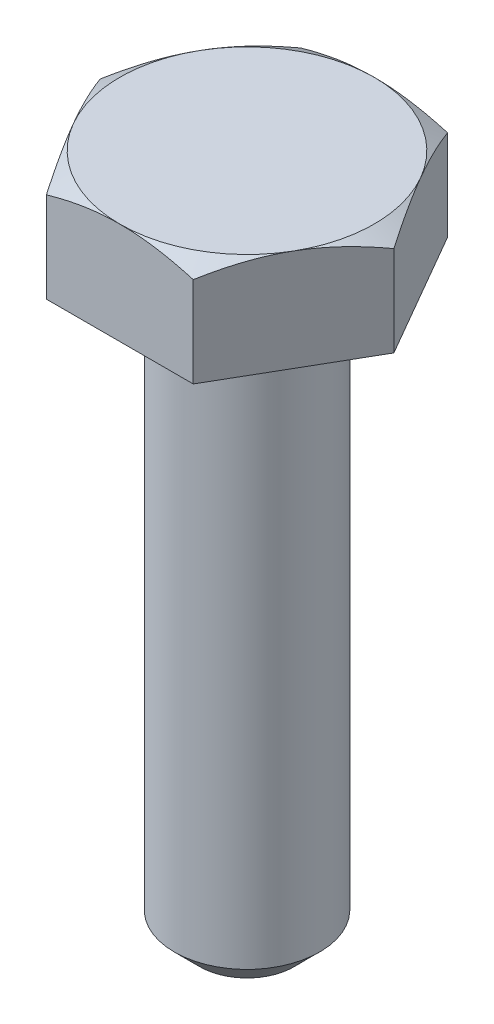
ISO-10303-21;
HEADER;
FILE_DESCRIPTION(('STEP AP214'),'2;1');
FILE_NAME('part.step','',(''),(''),'','','');
FILE_SCHEMA(('AUTOMOTIVE_DESIGN { 1 0 10303 214 1 1 1 1 }'));
ENDSEC;
DATA;
#1=APPLICATION_CONTEXT('core data for automotive mechanical design processes');
#2=APPLICATION_PROTOCOL_DEFINITION('international standard','automotive_design',2000,#1);
#3=PRODUCT_CONTEXT('',#1,'mechanical');
#4=PRODUCT('Part','Part','',(#3));
#5=PRODUCT_RELATED_PRODUCT_CATEGORY('part','',(#4));
#6=PRODUCT_DEFINITION_FORMATION('','',#4);
#7=PRODUCT_DEFINITION_CONTEXT('part definition',#1,'design');
#8=PRODUCT_DEFINITION('design','',#6,#7);
#9=PRODUCT_DEFINITION_SHAPE('','',#8);
#10=(LENGTH_UNIT() NAMED_UNIT(*) SI_UNIT(.MILLI.,.METRE.));
#11=(NAMED_UNIT(*) PLANE_ANGLE_UNIT() SI_UNIT($,.RADIAN.));
#12=(NAMED_UNIT(*) SI_UNIT($,.STERADIAN.) SOLID_ANGLE_UNIT());
#13=UNCERTAINTY_MEASURE_WITH_UNIT(LENGTH_MEASURE(1.E-05),#10,'distance_accuracy_value','');
#14=(GEOMETRIC_REPRESENTATION_CONTEXT(3) GLOBAL_UNCERTAINTY_ASSIGNED_CONTEXT((#13)) GLOBAL_UNIT_ASSIGNED_CONTEXT((#10,
#11,#12)) REPRESENTATION_CONTEXT('',''));
#15=CARTESIAN_POINT('',(0.,0.,0.));
#16=DIRECTION('',(0.,0.,1.));
#17=DIRECTION('',(1.,0.,0.));
#18=AXIS2_PLACEMENT_3D('',#15,#16,#17);
#19=CARTESIAN_POINT('',(0.,2.8,0.));
#20=DIRECTION('',(0.,-1.,0.));
#21=DIRECTION('',(1.,0.,0.));
#22=AXIS2_PLACEMENT_3D('',#19,#20,#21);
#23=PLANE('',#22);
#24=CARTESIAN_POINT('',(0.,2.79999999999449,0.));
#25=DIRECTION('',(0.,-1.,0.));
#26=DIRECTION('',(1.,0.,0.));
#27=AXIS2_PLACEMENT_3D('',#24,#25,#26);
#28=CIRCLE('',#27,3.50000000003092);
#29=CARTESIAN_POINT('',(3.03108891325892,2.80000000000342,1.75000000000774));
#30=VERTEX_POINT('',#29);
#31=CARTESIAN_POINT('',(0.,2.80000000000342,3.50000000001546));
#32=VERTEX_POINT('',#31);
#33=EDGE_CURVE('E89',#30,#32,#28,.T.);
#34=ORIENTED_EDGE('',*,*,#33,.F.);
#35=CARTESIAN_POINT('',(0.,2.79999999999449,0.));
#36=DIRECTION('',(0.,-1.,0.));
#37=DIRECTION('',(1.,0.,0.));
#38=AXIS2_PLACEMENT_3D('',#35,#36,#37);
#39=CIRCLE('',#38,3.50000000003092);
#40=CARTESIAN_POINT('',(3.03108891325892,2.80000000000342,-1.75000000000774));
#41=VERTEX_POINT('',#40);
#42=EDGE_CURVE('E87',#41,#30,#39,.T.);
#43=ORIENTED_EDGE('',*,*,#42,.F.);
#44=CARTESIAN_POINT('',(0.,2.79999999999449,0.));
#45=DIRECTION('',(0.,-1.,0.));
#46=DIRECTION('',(1.,0.,0.));
#47=AXIS2_PLACEMENT_3D('',#44,#45,#46);
#48=CIRCLE('',#47,3.50000000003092);
#49=CARTESIAN_POINT('',(0.,2.80000000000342,-3.50000000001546));
#50=VERTEX_POINT('',#49);
#51=EDGE_CURVE('E20',#50,#41,#48,.T.);
#52=ORIENTED_EDGE('',*,*,#51,.F.);
#53=CARTESIAN_POINT('',(0.,2.79999999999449,0.));
#54=DIRECTION('',(0.,-1.,0.));
#55=DIRECTION('',(1.,0.,0.));
#56=AXIS2_PLACEMENT_3D('',#53,#54,#55);
#57=CIRCLE('',#56,3.50000000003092);
#58=CARTESIAN_POINT('',(-3.03108891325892,2.80000000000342,-1.75000000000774));
#59=VERTEX_POINT('',#58);
#60=EDGE_CURVE('E104',#59,#50,#57,.T.);
#61=ORIENTED_EDGE('',*,*,#60,.F.);
#62=CARTESIAN_POINT('',(0.,2.79999999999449,0.));
#63=DIRECTION('',(0.,-1.,0.));
#64=DIRECTION('',(1.,0.,0.));
#65=AXIS2_PLACEMENT_3D('',#62,#63,#64);
#66=CIRCLE('',#65,3.50000000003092);
#67=CARTESIAN_POINT('',(-3.03108891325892,2.80000000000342,1.75000000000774));
#68=VERTEX_POINT('',#67);
#69=EDGE_CURVE('E323',#68,#59,#66,.T.);
#70=ORIENTED_EDGE('',*,*,#69,.F.);
#71=CARTESIAN_POINT('',(0.,2.79999999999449,0.));
#72=DIRECTION('',(0.,-1.,0.));
#73=DIRECTION('',(1.,0.,0.));
#74=AXIS2_PLACEMENT_3D('',#71,#72,#73);
#75=CIRCLE('',#74,3.50000000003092);
#76=EDGE_CURVE('E93',#32,#68,#75,.T.);
#77=ORIENTED_EDGE('',*,*,#76,.F.);
#78=EDGE_LOOP('',(#34,#43,#52,#61,#70,#77));
#79=FACE_BOUND('',#78,.T.);
#80=ADVANCED_FACE('F16',(#79),#23,.F.);
#81=CARTESIAN_POINT('',(0.,2.48551696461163,0.));
#82=DIRECTION('',(0.,-1.,0.));
#83=DIRECTION('',(1.,0.,0.));
#84=AXIS2_PLACEMENT_3D('',#81,#82,#83);
#85=CONICAL_SURFACE('',#84,4.04470059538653,1.04719755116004);
#86=ORIENTED_EDGE('',*,*,#51,.T.);
#87=CARTESIAN_POINT('',(2.02072594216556,2.4873926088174,-3.49999999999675));
#88=CARTESIAN_POINT('',(2.10296905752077,2.53488760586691,-3.35755074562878));
#89=CARTESIAN_POINT('',(2.18587080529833,2.5784013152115,-3.21396070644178));
#90=CARTESIAN_POINT('',(2.3524050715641,2.65513695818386,-2.92551489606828));
#91=CARTESIAN_POINT('',(2.43603178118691,2.68840978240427,-2.78066918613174));
#92=CARTESIAN_POINT('',(2.56226107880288,2.72926316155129,-2.56203362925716));
#93=CARTESIAN_POINT('',(2.60449696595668,2.741376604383,-2.48887892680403));
#94=CARTESIAN_POINT('',(2.68917094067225,2.762345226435,-2.34221930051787));
#95=CARTESIAN_POINT('',(2.7316090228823,2.771200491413,-2.26871438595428));
#96=CARTESIAN_POINT('',(2.81684436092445,2.78549717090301,-2.12108244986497));
#97=CARTESIAN_POINT('',(2.85964235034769,2.79092122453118,-2.04695415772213));
#98=CARTESIAN_POINT('',(2.94532249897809,2.79818014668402,-1.89855178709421));
#99=CARTESIAN_POINT('',(2.98820467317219,2.80001430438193,-1.82427768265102));
#100=CARTESIAN_POINT('',(3.03108891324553,2.80000000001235,-1.75000000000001));
#101=B_SPLINE_CURVE_WITH_KNOTS('',3,(#87,#88,#89,#90,#91,#92,#93,#94,#95,#96,#97,#98,#99,#100),
.UNSPECIFIED.,.F.,.F.,(4,2,2,2,2,2,4),(0.,0.513825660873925,1.02505510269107,1.28100524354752,
1.53694864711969,1.7941769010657,2.05145608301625),.UNSPECIFIED.);
#102=CARTESIAN_POINT('',(2.02072594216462,2.48739260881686,-3.49999999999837));
#103=VERTEX_POINT('',#102);
#104=EDGE_CURVE('E99',#103,#41,#101,.T.);
#105=ORIENTED_EDGE('',*,*,#104,.F.);
#106=CARTESIAN_POINT('',(0.,2.80000000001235,-3.49999999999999));
#107=CARTESIAN_POINT('',(0.0857684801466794,2.80001430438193,-3.49999999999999));
#108=CARTESIAN_POINT('',(0.171532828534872,2.79818014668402,-3.49999999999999));
#109=CARTESIAN_POINT('',(0.342893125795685,2.79092122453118,-3.49999999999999));
#110=CARTESIAN_POINT('',(0.428489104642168,2.78549717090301,-3.49999999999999));
#111=CARTESIAN_POINT('',(0.598959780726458,2.77120049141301,-3.49999999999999));
#112=CARTESIAN_POINT('',(0.683835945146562,2.76234522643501,-3.49999999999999));
#113=CARTESIAN_POINT('',(0.853183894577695,2.74137660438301,-3.49999999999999));
#114=CARTESIAN_POINT('',(0.937655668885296,2.7292631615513,-3.49999999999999));
#115=CARTESIAN_POINT('',(1.19011426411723,2.68840978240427,-3.49999999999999));
#116=CARTESIAN_POINT('',(1.35736768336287,2.65513695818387,-3.49999999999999));
#117=CARTESIAN_POINT('',(1.69043621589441,2.5784013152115,-3.49999999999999));
#118=CARTESIAN_POINT('',(1.85623971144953,2.53488760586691,-3.49999999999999));
#119=CARTESIAN_POINT('',(2.02072594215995,2.4873926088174,-3.49999999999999));
#120=B_SPLINE_CURVE_WITH_KNOTS('',3,(#106,#107,#108,#109,#110,#111,#112,#113,#114,#115,#116,
#117,#118,#119),.UNSPECIFIED.,.F.,.F.,(4,2,2,2,2,2,4),(0.,0.257279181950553,0.514507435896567,
0.770450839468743,1.02640098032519,1.53763042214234,2.05145608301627),.UNSPECIFIED.);
#121=EDGE_CURVE('E102',#50,#103,#120,.T.);
#122=ORIENTED_EDGE('',*,*,#121,.F.);
#123=EDGE_LOOP('',(#86,#105,#122));
#124=FACE_BOUND('',#123,.T.);
#125=ADVANCED_FACE('F97',(#124),#85,.T.);
#126=CARTESIAN_POINT('',(0.,2.48551696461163,0.));
#127=DIRECTION('',(0.,-1.,0.));
#128=DIRECTION('',(1.,0.,0.));
#129=AXIS2_PLACEMENT_3D('',#126,#127,#128);
#130=CONICAL_SURFACE('',#129,4.04470059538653,1.04719755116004);
#131=ORIENTED_EDGE('',*,*,#60,.T.);
#132=CARTESIAN_POINT('',(-2.02072594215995,2.4873926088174,-3.49999999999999));
#133=CARTESIAN_POINT('',(-1.85623971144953,2.53488760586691,-3.49999999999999));
#134=CARTESIAN_POINT('',(-1.69043621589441,2.5784013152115,-3.49999999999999));
#135=CARTESIAN_POINT('',(-1.35736768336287,2.65513695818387,-3.49999999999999));
#136=CARTESIAN_POINT('',(-1.19011426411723,2.68840978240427,-3.49999999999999));
#137=CARTESIAN_POINT('',(-0.937655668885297,2.7292631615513,-3.49999999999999));
#138=CARTESIAN_POINT('',(-0.853183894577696,2.74137660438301,-3.49999999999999));
#139=CARTESIAN_POINT('',(-0.683835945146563,2.76234522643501,-3.49999999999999));
#140=CARTESIAN_POINT('',(-0.598959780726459,2.77120049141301,-3.49999999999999));
#141=CARTESIAN_POINT('',(-0.428489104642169,2.78549717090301,-3.49999999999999));
#142=CARTESIAN_POINT('',(-0.342893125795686,2.79092122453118,-3.49999999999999));
#143=CARTESIAN_POINT('',(-0.171532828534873,2.79818014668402,-3.49999999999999));
#144=CARTESIAN_POINT('',(-0.0857684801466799,2.80001430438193,-3.49999999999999));
#145=CARTESIAN_POINT('',(0.,2.80000000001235,-3.49999999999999));
#146=B_SPLINE_CURVE_WITH_KNOTS('',3,(#132,#133,#134,#135,#136,#137,#138,#139,#140,#141,#142,
#143,#144,#145),.UNSPECIFIED.,.F.,.F.,(4,2,2,2,2,2,4),(0.,0.513825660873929,1.02505510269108,
1.28100524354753,1.53694864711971,1.79417690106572,2.05145608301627),.UNSPECIFIED.);
#147=CARTESIAN_POINT('',(-2.02072594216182,2.48739260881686,-3.49999999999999));
#148=VERTEX_POINT('',#147);
#149=EDGE_CURVE('E113',#148,#50,#146,.T.);
#150=ORIENTED_EDGE('',*,*,#149,.F.);
#151=CARTESIAN_POINT('',(-3.03108891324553,2.80000000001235,-1.75000000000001));
#152=CARTESIAN_POINT('',(-2.98820467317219,2.80001430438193,-1.82427768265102));
#153=CARTESIAN_POINT('',(-2.94532249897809,2.79818014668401,-1.89855178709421));
#154=CARTESIAN_POINT('',(-2.85964235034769,2.79092122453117,-2.04695415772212));
#155=CARTESIAN_POINT('',(-2.81684436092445,2.78549717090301,-2.12108244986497));
#156=CARTESIAN_POINT('',(-2.7316090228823,2.771200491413,-2.26871438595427));
#157=CARTESIAN_POINT('',(-2.68917094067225,2.762345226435,-2.34221930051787));
#158=CARTESIAN_POINT('',(-2.60449696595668,2.741376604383,-2.48887892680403));
#159=CARTESIAN_POINT('',(-2.56226107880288,2.72926316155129,-2.56203362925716));
#160=CARTESIAN_POINT('',(-2.43603178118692,2.68840978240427,-2.78066918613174));
#161=CARTESIAN_POINT('',(-2.3524050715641,2.65513695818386,-2.92551489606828));
#162=CARTESIAN_POINT('',(-2.18587080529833,2.5784013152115,-3.21396070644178));
#163=CARTESIAN_POINT('',(-2.10296905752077,2.53488760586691,-3.35755074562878));
#164=CARTESIAN_POINT('',(-2.02072594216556,2.4873926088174,-3.49999999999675));
#165=B_SPLINE_CURVE_WITH_KNOTS('',3,(#151,#152,#153,#154,#155,#156,#157,#158,#159,#160,#161,
#162,#163,#164),.UNSPECIFIED.,.F.,.F.,(4,2,2,2,2,2,4),(0.,0.257279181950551,0.514507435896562,
0.770450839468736,1.02640098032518,1.53763042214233,2.05145608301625),.UNSPECIFIED.);
#166=EDGE_CURVE('E169',#59,#148,#165,.T.);
#167=ORIENTED_EDGE('',*,*,#166,.F.);
#168=EDGE_LOOP('',(#131,#150,#167));
#169=FACE_BOUND('',#168,.T.);
#170=ADVANCED_FACE('F137',(#169),#130,.T.);
#171=CARTESIAN_POINT('',(0.,2.48551696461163,0.));
#172=DIRECTION('',(0.,-1.,0.));
#173=DIRECTION('',(1.,0.,0.));
#174=AXIS2_PLACEMENT_3D('',#171,#172,#173);
#175=CONICAL_SURFACE('',#174,4.04470059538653,1.04719755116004);
#176=ORIENTED_EDGE('',*,*,#69,.T.);
#177=CARTESIAN_POINT('',(-4.04145188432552,2.48739260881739,-3.24094856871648E-12));
#178=CARTESIAN_POINT('',(-3.95920876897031,2.5348876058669,-0.142449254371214));
#179=CARTESIAN_POINT('',(-3.87630702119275,2.57840131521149,-0.286039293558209));
#180=CARTESIAN_POINT('',(-3.70977275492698,2.65513695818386,-0.574485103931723));
#181=CARTESIAN_POINT('',(-3.62614604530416,2.68840978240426,-0.719330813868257));
#182=CARTESIAN_POINT('',(-3.49991674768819,2.72926316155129,-0.937966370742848));
#183=CARTESIAN_POINT('',(-3.45768086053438,2.741376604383,-1.01112107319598));
#184=CARTESIAN_POINT('',(-3.37300688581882,2.762345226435,-1.15778069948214));
#185=CARTESIAN_POINT('',(-3.33056880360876,2.771200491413,-1.23128561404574));
#186=CARTESIAN_POINT('',(-3.24533346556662,2.78549717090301,-1.37891755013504));
#187=CARTESIAN_POINT('',(-3.20253547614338,2.79092122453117,-1.45304584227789));
#188=CARTESIAN_POINT('',(-3.11685532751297,2.79818014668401,-1.60144821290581));
#189=CARTESIAN_POINT('',(-3.07397315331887,2.80001430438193,-1.675722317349));
#190=CARTESIAN_POINT('',(-3.03108891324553,2.80000000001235,-1.75000000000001));
#191=B_SPLINE_CURVE_WITH_KNOTS('',3,(#177,#178,#179,#180,#181,#182,#183,#184,#185,#186,#187,
#188,#189,#190),.UNSPECIFIED.,.F.,.F.,(4,2,2,2,2,2,4),(0.,0.513825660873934,1.02505510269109,
1.28100524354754,1.53694864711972,1.79417690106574,2.05145608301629),.UNSPECIFIED.);
#192=CARTESIAN_POINT('',(-4.04145188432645,2.48739260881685,-1.62018098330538E-12));
#193=VERTEX_POINT('',#192);
#194=EDGE_CURVE('E146',#193,#59,#191,.T.);
#195=ORIENTED_EDGE('',*,*,#194,.F.);
#196=CARTESIAN_POINT('',(-3.03108891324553,2.80000000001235,1.75000000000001));
#197=CARTESIAN_POINT('',(-3.07397315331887,2.80001430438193,1.675722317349));
#198=CARTESIAN_POINT('',(-3.11685532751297,2.79818014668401,1.60144821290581));
#199=CARTESIAN_POINT('',(-3.20253547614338,2.79092122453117,1.45304584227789));
#200=CARTESIAN_POINT('',(-3.24533346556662,2.78549717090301,1.37891755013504));
#201=CARTESIAN_POINT('',(-3.33056880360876,2.771200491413,1.23128561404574));
#202=CARTESIAN_POINT('',(-3.37300688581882,2.762345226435,1.15778069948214));
#203=CARTESIAN_POINT('',(-3.45768086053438,2.741376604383,1.01112107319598));
#204=CARTESIAN_POINT('',(-3.49991674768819,2.72926316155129,0.937966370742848));
#205=CARTESIAN_POINT('',(-3.62614604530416,2.68840978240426,0.719330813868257));
#206=CARTESIAN_POINT('',(-3.70977275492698,2.65513695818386,0.574485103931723));
#207=CARTESIAN_POINT('',(-3.87630702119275,2.57840131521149,0.286039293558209));
#208=CARTESIAN_POINT('',(-3.95920876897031,2.5348876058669,0.142449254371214));
#209=CARTESIAN_POINT('',(-4.04145188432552,2.48739260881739,3.2412585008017E-12));
#210=B_SPLINE_CURVE_WITH_KNOTS('',3,(#196,#197,#198,#199,#200,#201,#202,#203,#204,#205,#206,
#207,#208,#209),.UNSPECIFIED.,.F.,.F.,(4,2,2,2,2,2,4),(0.,0.257279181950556,0.514507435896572,
0.77045083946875,1.0264009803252,1.53763042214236,2.05145608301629),.UNSPECIFIED.);
#211=EDGE_CURVE('E183',#68,#193,#210,.T.);
#212=ORIENTED_EDGE('',*,*,#211,.F.);
#213=EDGE_LOOP('',(#176,#195,#212));
#214=FACE_BOUND('',#213,.T.);
#215=ADVANCED_FACE('F191',(#214),#175,.T.);
#216=CARTESIAN_POINT('',(0.,2.48551696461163,0.));
#217=DIRECTION('',(0.,-1.,0.));
#218=DIRECTION('',(1.,0.,0.));
#219=AXIS2_PLACEMENT_3D('',#216,#217,#218);
#220=CONICAL_SURFACE('',#219,4.04470059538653,1.04719755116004);
#221=ORIENTED_EDGE('',*,*,#76,.T.);
#222=CARTESIAN_POINT('',(-2.02072594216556,2.4873926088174,3.49999999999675));
#223=CARTESIAN_POINT('',(-2.10296905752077,2.53488760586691,3.35755074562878));
#224=CARTESIAN_POINT('',(-2.18587080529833,2.5784013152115,3.21396070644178));
#225=CARTESIAN_POINT('',(-2.3524050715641,2.65513695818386,2.92551489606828));
#226=CARTESIAN_POINT('',(-2.43603178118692,2.68840978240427,2.78066918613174));
#227=CARTESIAN_POINT('',(-2.56226107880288,2.72926316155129,2.56203362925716));
#228=CARTESIAN_POINT('',(-2.60449696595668,2.741376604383,2.48887892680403));
#229=CARTESIAN_POINT('',(-2.68917094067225,2.762345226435,2.34221930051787));
#230=CARTESIAN_POINT('',(-2.7316090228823,2.771200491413,2.26871438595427));
#231=CARTESIAN_POINT('',(-2.81684436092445,2.78549717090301,2.12108244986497));
#232=CARTESIAN_POINT('',(-2.85964235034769,2.79092122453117,2.04695415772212));
#233=CARTESIAN_POINT('',(-2.94532249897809,2.79818014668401,1.89855178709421));
#234=CARTESIAN_POINT('',(-2.98820467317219,2.80001430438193,1.82427768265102));
#235=CARTESIAN_POINT('',(-3.03108891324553,2.80000000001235,1.75000000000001));
#236=B_SPLINE_CURVE_WITH_KNOTS('',3,(#222,#223,#224,#225,#226,#227,#228,#229,#230,#231,#232,
#233,#234,#235),.UNSPECIFIED.,.F.,.F.,(4,2,2,2,2,2,4),(0.,0.513825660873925,1.02505510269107,
1.28100524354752,1.53694864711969,1.7941769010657,2.05145608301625),.UNSPECIFIED.);
#237=CARTESIAN_POINT('',(-2.02072594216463,2.48739260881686,3.49999999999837));
#238=VERTEX_POINT('',#237);
#239=EDGE_CURVE('E176',#238,#68,#236,.T.);
#240=ORIENTED_EDGE('',*,*,#239,.F.);
#241=CARTESIAN_POINT('',(0.,2.80000000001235,3.49999999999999));
#242=CARTESIAN_POINT('',(-0.0857684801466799,2.80001430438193,3.49999999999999));
#243=CARTESIAN_POINT('',(-0.171532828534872,2.79818014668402,3.49999999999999));
#244=CARTESIAN_POINT('',(-0.342893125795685,2.79092122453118,3.49999999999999));
#245=CARTESIAN_POINT('',(-0.428489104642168,2.78549717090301,3.49999999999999));
#246=CARTESIAN_POINT('',(-0.598959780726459,2.77120049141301,3.49999999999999));
#247=CARTESIAN_POINT('',(-0.683835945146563,2.76234522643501,3.49999999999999));
#248=CARTESIAN_POINT('',(-0.853183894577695,2.74137660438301,3.49999999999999));
#249=CARTESIAN_POINT('',(-0.937655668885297,2.7292631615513,3.49999999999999));
#250=CARTESIAN_POINT('',(-1.19011426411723,2.68840978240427,3.49999999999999));
#251=CARTESIAN_POINT('',(-1.35736768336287,2.65513695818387,3.49999999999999));
#252=CARTESIAN_POINT('',(-1.69043621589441,2.5784013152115,3.49999999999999));
#253=CARTESIAN_POINT('',(-1.85623971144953,2.53488760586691,3.49999999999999));
#254=CARTESIAN_POINT('',(-2.02072594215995,2.4873926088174,3.49999999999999));
#255=B_SPLINE_CURVE_WITH_KNOTS('',3,(#241,#242,#243,#244,#245,#246,#247,#248,#249,#250,#251,
#252,#253,#254),.UNSPECIFIED.,.F.,.F.,(4,2,2,2,2,2,4),(0.,0.257279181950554,0.514507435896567,
0.770450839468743,1.02640098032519,1.53763042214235,2.05145608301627),.UNSPECIFIED.);
#256=EDGE_CURVE('E198',#32,#238,#255,.T.);
#257=ORIENTED_EDGE('',*,*,#256,.F.);
#258=EDGE_LOOP('',(#221,#240,#257));
#259=FACE_BOUND('',#258,.T.);
#260=ADVANCED_FACE('F188',(#259),#220,.T.);
#261=CARTESIAN_POINT('',(0.,2.48551696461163,0.));
#262=DIRECTION('',(0.,-1.,0.));
#263=DIRECTION('',(1.,0.,0.));
#264=AXIS2_PLACEMENT_3D('',#261,#262,#263);
#265=CONICAL_SURFACE('',#264,4.04470059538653,1.04719755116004);
#266=ORIENTED_EDGE('',*,*,#42,.T.);
#267=CARTESIAN_POINT('',(4.04145188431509,2.48739260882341,2.13024001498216E-11));
#268=CARTESIAN_POINT('',(3.9592087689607,2.53488760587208,0.142449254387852));
#269=CARTESIAN_POINT('',(3.87630702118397,2.57840131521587,0.286039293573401));
#270=CARTESIAN_POINT('',(3.70977275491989,2.65513695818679,0.574485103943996));
#271=CARTESIAN_POINT('',(3.62614604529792,2.68840978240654,0.719330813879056));
#272=CARTESIAN_POINT('',(3.49991674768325,2.72926316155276,0.937966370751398));
#273=CARTESIAN_POINT('',(3.45768086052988,2.74137660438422,1.01112107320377));
#274=CARTESIAN_POINT('',(3.3730068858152,2.76234522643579,1.15778069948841));
#275=CARTESIAN_POINT('',(3.33056880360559,2.77120049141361,1.23128561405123));
#276=CARTESIAN_POINT('',(3.24533346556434,2.78549717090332,1.37891755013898));
#277=CARTESIAN_POINT('',(3.20253547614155,2.79092122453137,1.45304584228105));
#278=CARTESIAN_POINT('',(3.11685532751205,2.79818014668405,1.60144821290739));
#279=CARTESIAN_POINT('',(3.07397315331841,2.80001430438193,1.6757223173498));
#280=CARTESIAN_POINT('',(3.03108891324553,2.80000000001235,1.75000000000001));
#281=B_SPLINE_CURVE_WITH_KNOTS('',3,(#267,#268,#269,#270,#271,#272,#273,#274,#275,#276,#277,
#278,#279,#280),.UNSPECIFIED.,.F.,.F.,(4,2,2,2,2,2,4),(0.,0.51382566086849,1.02505510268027,
1.28100524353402,1.53694864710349,1.79417690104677,2.05145608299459),.UNSPECIFIED.);
#282=CARTESIAN_POINT('',(4.04145188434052,2.48739260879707,-1.0651035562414E-11));
#283=VERTEX_POINT('',#282);
#284=EDGE_CURVE('E109',#283,#30,#281,.T.);
#285=ORIENTED_EDGE('',*,*,#284,.F.);
#286=CARTESIAN_POINT('',(3.03108891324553,2.80000000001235,-1.75000000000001));
#287=CARTESIAN_POINT('',(3.07397315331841,2.80001430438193,-1.6757223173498));
#288=CARTESIAN_POINT('',(3.11685532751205,2.79818014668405,-1.60144821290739));
#289=CARTESIAN_POINT('',(3.20253547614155,2.79092122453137,-1.45304584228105));
#290=CARTESIAN_POINT('',(3.24533346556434,2.78549717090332,-1.37891755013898));
#291=CARTESIAN_POINT('',(3.33056880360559,2.77120049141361,-1.23128561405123));
#292=CARTESIAN_POINT('',(3.3730068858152,2.76234522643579,-1.15778069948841));
#293=CARTESIAN_POINT('',(3.45768086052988,2.74137660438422,-1.01112107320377));
#294=CARTESIAN_POINT('',(3.49991674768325,2.72926316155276,-0.937966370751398));
#295=CARTESIAN_POINT('',(3.62614604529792,2.68840978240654,-0.719330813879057));
#296=CARTESIAN_POINT('',(3.70977275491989,2.65513695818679,-0.574485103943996));
#297=CARTESIAN_POINT('',(3.87630702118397,2.57840131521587,-0.286039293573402));
#298=CARTESIAN_POINT('',(3.9592087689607,2.53488760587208,-0.142449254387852));
#299=CARTESIAN_POINT('',(4.04145188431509,2.48739260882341,-2.13026023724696E-11));
#300=B_SPLINE_CURVE_WITH_KNOTS('',3,(#286,#287,#288,#289,#290,#291,#292,#293,#294,#295,#296,
#297,#298,#299),.UNSPECIFIED.,.F.,.F.,(4,2,2,2,2,2,4),(0.,0.257279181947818,0.514507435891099,
0.770450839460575,1.02640098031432,1.5376304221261,2.05145608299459),.UNSPECIFIED.);
#301=EDGE_CURVE('E106',#41,#283,#300,.T.);
#302=ORIENTED_EDGE('',*,*,#301,.F.);
#303=EDGE_LOOP('',(#266,#285,#302));
#304=FACE_BOUND('',#303,.T.);
#305=ADVANCED_FACE('F107',(#304),#265,.T.);
#306=CARTESIAN_POINT('',(0.,2.48551696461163,0.));
#307=DIRECTION('',(0.,-1.,0.));
#308=DIRECTION('',(1.,0.,0.));
#309=AXIS2_PLACEMENT_3D('',#306,#307,#308);
#310=CONICAL_SURFACE('',#309,4.04470059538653,1.04719755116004);
#311=ORIENTED_EDGE('',*,*,#33,.T.);
#312=CARTESIAN_POINT('',(2.02072594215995,2.4873926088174,3.49999999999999));
#313=CARTESIAN_POINT('',(1.85623971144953,2.53488760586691,3.49999999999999));
#314=CARTESIAN_POINT('',(1.69043621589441,2.5784013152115,3.49999999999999));
#315=CARTESIAN_POINT('',(1.35736768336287,2.65513695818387,3.49999999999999));
#316=CARTESIAN_POINT('',(1.19011426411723,2.68840978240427,3.49999999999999));
#317=CARTESIAN_POINT('',(0.937655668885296,2.7292631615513,3.49999999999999));
#318=CARTESIAN_POINT('',(0.853183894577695,2.74137660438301,3.49999999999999));
#319=CARTESIAN_POINT('',(0.683835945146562,2.76234522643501,3.49999999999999));
#320=CARTESIAN_POINT('',(0.598959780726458,2.77120049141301,3.49999999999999));
#321=CARTESIAN_POINT('',(0.428489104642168,2.78549717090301,3.49999999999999));
#322=CARTESIAN_POINT('',(0.342893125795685,2.79092122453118,3.49999999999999));
#323=CARTESIAN_POINT('',(0.171532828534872,2.79818014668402,3.49999999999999));
#324=CARTESIAN_POINT('',(0.0857684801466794,2.80001430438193,3.49999999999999));
#325=CARTESIAN_POINT('',(0.,2.80000000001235,3.49999999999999));
#326=B_SPLINE_CURVE_WITH_KNOTS('',3,(#312,#313,#314,#315,#316,#317,#318,#319,#320,#321,#322,
#323,#324,#325),.UNSPECIFIED.,.F.,.F.,(4,2,2,2,2,2,4),(0.,0.513825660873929,1.02505510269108,
1.28100524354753,1.53694864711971,1.79417690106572,2.05145608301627),.UNSPECIFIED.);
#327=CARTESIAN_POINT('',(2.02072594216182,2.48739260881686,3.49999999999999));
#328=VERTEX_POINT('',#327);
#329=EDGE_CURVE('E205',#328,#32,#326,.T.);
#330=ORIENTED_EDGE('',*,*,#329,.F.);
#331=CARTESIAN_POINT('',(3.03108891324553,2.80000000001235,1.75000000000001));
#332=CARTESIAN_POINT('',(2.98820467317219,2.80001430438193,1.82427768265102));
#333=CARTESIAN_POINT('',(2.94532249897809,2.79818014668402,1.89855178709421));
#334=CARTESIAN_POINT('',(2.85964235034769,2.79092122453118,2.04695415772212));
#335=CARTESIAN_POINT('',(2.81684436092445,2.78549717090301,2.12108244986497));
#336=CARTESIAN_POINT('',(2.7316090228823,2.771200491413,2.26871438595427));
#337=CARTESIAN_POINT('',(2.68917094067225,2.762345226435,2.34221930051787));
#338=CARTESIAN_POINT('',(2.60449696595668,2.741376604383,2.48887892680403));
#339=CARTESIAN_POINT('',(2.56226107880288,2.72926316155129,2.56203362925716));
#340=CARTESIAN_POINT('',(2.43603178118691,2.68840978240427,2.78066918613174));
#341=CARTESIAN_POINT('',(2.3524050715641,2.65513695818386,2.92551489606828));
#342=CARTESIAN_POINT('',(2.18587080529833,2.5784013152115,3.21396070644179));
#343=CARTESIAN_POINT('',(2.10296905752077,2.53488760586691,3.35755074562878));
#344=CARTESIAN_POINT('',(2.02072594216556,2.4873926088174,3.49999999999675));
#345=B_SPLINE_CURVE_WITH_KNOTS('',3,(#331,#332,#333,#334,#335,#336,#337,#338,#339,#340,#341,
#342,#343,#344),.UNSPECIFIED.,.F.,.F.,(4,2,2,2,2,2,4),(0.,0.257279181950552,0.514507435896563,
0.770450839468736,1.02640098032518,1.53763042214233,2.05145608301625),.UNSPECIFIED.);
#346=EDGE_CURVE('E225',#30,#328,#345,.T.);
#347=ORIENTED_EDGE('',*,*,#346,.F.);
#348=EDGE_LOOP('',(#311,#330,#347));
#349=FACE_BOUND('',#348,.T.);
#350=ADVANCED_FACE('F233',(#349),#310,.T.);
#351=CARTESIAN_POINT('',(0.,-16.,0.));
#352=DIRECTION('',(0.,1.,0.));
#353=DIRECTION('',(0.,0.,1.));
#354=AXIS2_PLACEMENT_3D('',#351,#352,#353);
#355=PLANE('',#354);
#356=CARTESIAN_POINT('',(0.,-15.9999999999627,0.));
#357=DIRECTION('',(0.,1.,0.));
#358=DIRECTION('',(0.,0.,1.));
#359=AXIS2_PLACEMENT_3D('',#356,#357,#358);
#360=CIRCLE('',#359,1.30000000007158);
#361=CARTESIAN_POINT('',(0.,-15.9999999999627,1.30000000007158));
#362=VERTEX_POINT('',#361);
#363=EDGE_CURVE('E232',#362,#362,#360,.T.);
#364=ORIENTED_EDGE('',*,*,#363,.F.);
#365=EDGE_LOOP('',(#364));
#366=FACE_BOUND('',#365,.T.);
#367=ADVANCED_FACE('F236',(#366),#355,.F.);
#368=CARTESIAN_POINT('',(2.02072594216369,16.94,-3.49999999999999));
#369=DIRECTION('',(0.866025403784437,0.,-0.500000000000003));
#370=DIRECTION('',(-0.500000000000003,0.,-0.866025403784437));
#371=AXIS2_PLACEMENT_3D('',#368,#369,#370);
#372=PLANE('',#371);
#373=DIRECTION('',(-0.500000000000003,0.,-0.866025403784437));
#374=VECTOR('',#373,1.);
#375=CARTESIAN_POINT('',(4.04145188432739,0.,0.));
#376=LINE('',#375,#374);
#377=CARTESIAN_POINT('',(4.04145188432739,0.,0.));
#378=VERTEX_POINT('',#377);
#379=CARTESIAN_POINT('',(2.02072594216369,0.,-3.49999999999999));
#380=VERTEX_POINT('',#379);
#381=EDGE_CURVE('E269',#378,#380,#376,.T.);
#382=ORIENTED_EDGE('',*,*,#381,.T.);
#383=DIRECTION('',(0.,1.,0.));
#384=VECTOR('',#383,1.);
#385=CARTESIAN_POINT('',(2.02072594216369,16.94,-3.49999999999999));
#386=LINE('',#385,#384);
#387=EDGE_CURVE('E117',#103,#380,#386,.F.);
#388=ORIENTED_EDGE('',*,*,#387,.F.);
#389=ORIENTED_EDGE('',*,*,#104,.T.);
#390=ORIENTED_EDGE('',*,*,#301,.T.);
#391=DIRECTION('',(0.,1.,0.));
#392=VECTOR('',#391,1.);
#393=CARTESIAN_POINT('',(4.04145188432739,16.94,0.));
#394=LINE('',#393,#392);
#395=EDGE_CURVE('E312',#378,#283,#394,.T.);
#396=ORIENTED_EDGE('',*,*,#395,.F.);
#397=EDGE_LOOP('',(#382,#388,#389,#390,#396));
#398=FACE_BOUND('',#397,.T.);
#399=ADVANCED_FACE('F115',(#398),#372,.T.);
#400=CARTESIAN_POINT('',(-2.02072594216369,16.94,-3.49999999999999));
#401=DIRECTION('',(0.,0.,-1.));
#402=DIRECTION('',(-1.,0.,0.));
#403=AXIS2_PLACEMENT_3D('',#400,#401,#402);
#404=PLANE('',#403);
#405=DIRECTION('',(-1.,0.,0.));
#406=VECTOR('',#405,1.);
#407=CARTESIAN_POINT('',(0.,0.,-3.49999999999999));
#408=LINE('',#407,#406);
#409=CARTESIAN_POINT('',(-2.02072594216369,0.,-3.49999999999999));
#410=VERTEX_POINT('',#409);
#411=EDGE_CURVE('E271',#380,#410,#408,.T.);
#412=ORIENTED_EDGE('',*,*,#411,.T.);
#413=DIRECTION('',(0.,1.,0.));
#414=VECTOR('',#413,1.);
#415=CARTESIAN_POINT('',(-2.02072594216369,16.94,-3.49999999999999));
#416=LINE('',#415,#414);
#417=EDGE_CURVE('E175',#148,#410,#416,.F.);
#418=ORIENTED_EDGE('',*,*,#417,.F.);
#419=ORIENTED_EDGE('',*,*,#149,.T.);
#420=ORIENTED_EDGE('',*,*,#121,.T.);
#421=ORIENTED_EDGE('',*,*,#387,.T.);
#422=EDGE_LOOP('',(#412,#418,#419,#420,#421));
#423=FACE_BOUND('',#422,.T.);
#424=ADVANCED_FACE('F155',(#423),#404,.T.);
#425=CARTESIAN_POINT('',(-2.02072594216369,16.94,-3.49999999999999));
#426=DIRECTION('',(-0.866025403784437,0.,-0.500000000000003));
#427=DIRECTION('',(-0.500000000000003,0.,0.866025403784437));
#428=AXIS2_PLACEMENT_3D('',#425,#426,#427);
#429=PLANE('',#428);
#430=DIRECTION('',(-0.500000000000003,0.,0.866025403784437));
#431=VECTOR('',#430,1.);
#432=CARTESIAN_POINT('',(-2.02072594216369,0.,-3.49999999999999));
#433=LINE('',#432,#431);
#434=CARTESIAN_POINT('',(-4.04145188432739,0.,0.));
#435=VERTEX_POINT('',#434);
#436=EDGE_CURVE('E279',#410,#435,#433,.T.);
#437=ORIENTED_EDGE('',*,*,#436,.T.);
#438=DIRECTION('',(0.,1.,0.));
#439=VECTOR('',#438,1.);
#440=CARTESIAN_POINT('',(-4.04145188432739,16.94,0.));
#441=LINE('',#440,#439);
#442=EDGE_CURVE('E302',#193,#435,#441,.F.);
#443=ORIENTED_EDGE('',*,*,#442,.F.);
#444=ORIENTED_EDGE('',*,*,#194,.T.);
#445=ORIENTED_EDGE('',*,*,#166,.T.);
#446=ORIENTED_EDGE('',*,*,#417,.T.);
#447=EDGE_LOOP('',(#437,#443,#444,#445,#446));
#448=FACE_BOUND('',#447,.T.);
#449=ADVANCED_FACE('F158',(#448),#429,.T.);
#450=CARTESIAN_POINT('',(-2.02072594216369,16.94,3.49999999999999));
#451=DIRECTION('',(-0.866025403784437,0.,0.500000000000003));
#452=DIRECTION('',(0.500000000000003,0.,0.866025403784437));
#453=AXIS2_PLACEMENT_3D('',#450,#451,#452);
#454=PLANE('',#453);
#455=DIRECTION('',(0.500000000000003,0.,0.866025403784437));
#456=VECTOR('',#455,1.);
#457=CARTESIAN_POINT('',(-4.04145188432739,0.,0.));
#458=LINE('',#457,#456);
#459=CARTESIAN_POINT('',(-2.02072594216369,0.,3.49999999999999));
#460=VERTEX_POINT('',#459);
#461=EDGE_CURVE('E275',#435,#460,#458,.T.);
#462=ORIENTED_EDGE('',*,*,#461,.T.);
#463=DIRECTION('',(0.,1.,0.));
#464=VECTOR('',#463,1.);
#465=CARTESIAN_POINT('',(-2.02072594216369,16.94,3.49999999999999));
#466=LINE('',#465,#464);
#467=EDGE_CURVE('E204',#238,#460,#466,.F.);
#468=ORIENTED_EDGE('',*,*,#467,.F.);
#469=ORIENTED_EDGE('',*,*,#239,.T.);
#470=ORIENTED_EDGE('',*,*,#211,.T.);
#471=ORIENTED_EDGE('',*,*,#442,.T.);
#472=EDGE_LOOP('',(#462,#468,#469,#470,#471));
#473=FACE_BOUND('',#472,.T.);
#474=ADVANCED_FACE('F164',(#473),#454,.T.);
#475=CARTESIAN_POINT('',(-2.02072594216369,16.94,3.49999999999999));
#476=DIRECTION('',(0.,0.,1.));
#477=DIRECTION('',(1.,0.,0.));
#478=AXIS2_PLACEMENT_3D('',#475,#476,#477);
#479=PLANE('',#478);
#480=DIRECTION('',(-1.,0.,0.));
#481=VECTOR('',#480,1.);
#482=CARTESIAN_POINT('',(0.,0.,3.49999999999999));
#483=LINE('',#482,#481);
#484=CARTESIAN_POINT('',(2.02072594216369,0.,3.49999999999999));
#485=VERTEX_POINT('',#484);
#486=EDGE_CURVE('E35',#460,#485,#483,.F.);
#487=ORIENTED_EDGE('',*,*,#486,.T.);
#488=DIRECTION('',(0.,1.,0.));
#489=VECTOR('',#488,1.);
#490=CARTESIAN_POINT('',(2.02072594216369,16.94,3.49999999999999));
#491=LINE('',#490,#489);
#492=EDGE_CURVE('E231',#328,#485,#491,.F.);
#493=ORIENTED_EDGE('',*,*,#492,.F.);
#494=ORIENTED_EDGE('',*,*,#329,.T.);
#495=ORIENTED_EDGE('',*,*,#256,.T.);
#496=ORIENTED_EDGE('',*,*,#467,.T.);
#497=EDGE_LOOP('',(#487,#493,#494,#495,#496));
#498=FACE_BOUND('',#497,.T.);
#499=ADVANCED_FACE('F214',(#498),#479,.T.);
#500=CARTESIAN_POINT('',(2.02072594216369,16.94,3.49999999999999));
#501=DIRECTION('',(0.866025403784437,0.,0.500000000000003));
#502=DIRECTION('',(0.500000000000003,0.,-0.866025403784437));
#503=AXIS2_PLACEMENT_3D('',#500,#501,#502);
#504=PLANE('',#503);
#505=DIRECTION('',(0.500000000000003,0.,-0.866025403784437));
#506=VECTOR('',#505,1.);
#507=CARTESIAN_POINT('',(2.02072594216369,0.,3.49999999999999));
#508=LINE('',#507,#506);
#509=EDGE_CURVE('E259',#485,#378,#508,.T.);
#510=ORIENTED_EDGE('',*,*,#509,.T.);
#511=ORIENTED_EDGE('',*,*,#395,.T.);
#512=ORIENTED_EDGE('',*,*,#284,.T.);
#513=ORIENTED_EDGE('',*,*,#346,.T.);
#514=ORIENTED_EDGE('',*,*,#492,.T.);
#515=EDGE_LOOP('',(#510,#511,#512,#513,#514));
#516=FACE_BOUND('',#515,.T.);
#517=ADVANCED_FACE('F217',(#516),#504,.T.);
#518=CARTESIAN_POINT('',(0.,-15.3000000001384,0.));
#519=DIRECTION('',(0.,1.,0.));
#520=DIRECTION('',(0.,0.,1.));
#521=AXIS2_PLACEMENT_3D('',#518,#519,#520);
#522=CONICAL_SURFACE('',#521,1.99999999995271,0.785398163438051);
#523=ORIENTED_EDGE('',*,*,#363,.T.);
#524=EDGE_LOOP('',(#523));
#525=FACE_BOUND('',#524,.T.);
#526=CARTESIAN_POINT('',(0.,-15.3,0.));
#527=DIRECTION('',(0.,1.,0.));
#528=DIRECTION('',(0.,0.,1.));
#529=AXIS2_PLACEMENT_3D('',#526,#527,#528);
#530=CIRCLE('',#529,2.);
#531=CARTESIAN_POINT('',(0.,-15.3,2.));
#532=VERTEX_POINT('',#531);
#533=EDGE_CURVE('E26',#532,#532,#530,.T.);
#534=ORIENTED_EDGE('',*,*,#533,.F.);
#535=EDGE_LOOP('',(#534));
#536=FACE_BOUND('',#535,.T.);
#537=ADVANCED_FACE('F222',(#525,#536),#522,.T.);
#538=CARTESIAN_POINT('',(0.,0.,0.));
#539=DIRECTION('',(0.,1.,0.));
#540=DIRECTION('',(-1.,0.,0.));
#541=AXIS2_PLACEMENT_3D('',#538,#539,#540);
#542=PLANE('',#541);
#543=ORIENTED_EDGE('',*,*,#486,.F.);
#544=ORIENTED_EDGE('',*,*,#461,.F.);
#545=ORIENTED_EDGE('',*,*,#436,.F.);
#546=ORIENTED_EDGE('',*,*,#411,.F.);
#547=ORIENTED_EDGE('',*,*,#381,.F.);
#548=ORIENTED_EDGE('',*,*,#509,.F.);
#549=EDGE_LOOP('',(#543,#544,#545,#546,#547,#548));
#550=FACE_BOUND('',#549,.T.);
#551=CARTESIAN_POINT('',(0.,0.,0.));
#552=DIRECTION('',(0.,1.,0.));
#553=DIRECTION('',(0.,0.,1.));
#554=AXIS2_PLACEMENT_3D('',#551,#552,#553);
#555=CIRCLE('',#554,2.);
#556=CARTESIAN_POINT('',(0.,0.,2.));
#557=VERTEX_POINT('',#556);
#558=EDGE_CURVE('E10',#557,#557,#555,.F.);
#559=ORIENTED_EDGE('',*,*,#558,.F.);
#560=EDGE_LOOP('',(#559));
#561=FACE_BOUND('',#560,.T.);
#562=ADVANCED_FACE('F247',(#550,#561),#542,.F.);
#563=CARTESIAN_POINT('',(0.,-16.,0.));
#564=DIRECTION('',(0.,1.,0.));
#565=DIRECTION('',(0.,0.,1.));
#566=AXIS2_PLACEMENT_3D('',#563,#564,#565);
#567=CYLINDRICAL_SURFACE('',#566,2.);
#568=ORIENTED_EDGE('',*,*,#533,.T.);
#569=EDGE_LOOP('',(#568));
#570=FACE_BOUND('',#569,.T.);
#571=ORIENTED_EDGE('',*,*,#558,.T.);
#572=EDGE_LOOP('',(#571));
#573=FACE_BOUND('',#572,.T.);
#574=ADVANCED_FACE('F18',(#570,#573),#567,.T.);
#575=CLOSED_SHELL('',(#80,#125,#170,#215,#260,#305,#350,#367,#399,#424,#449,#474,#499,#517,#537,
#562,#574));
#576=MANIFOLD_SOLID_BREP('B1',#575);
#577=ADVANCED_BREP_SHAPE_REPRESENTATION('',(#18,#576),#14);
#578=SHAPE_DEFINITION_REPRESENTATION(#9,#577);
ENDSEC;
END-ISO-10303-21;
